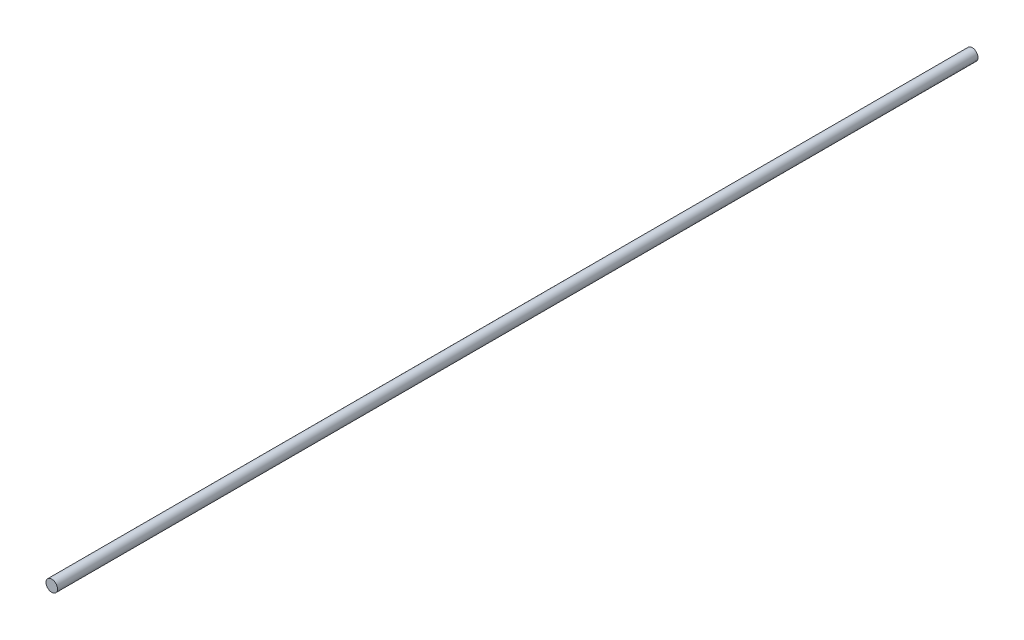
from build123d import *

# Parameters (mm, degrees)
SKETCH1_R           = 30
BOSS_EXTRUDE1_DEPTH = 4800


with BuildPart() as part:
    # Sketch1 → Boss-Extrude1 (new body)
    with BuildSketch(Plane.XY):
        Circle(SKETCH1_R)
    extrude(amount=-BOSS_EXTRUDE1_DEPTH)


solid = part.part
